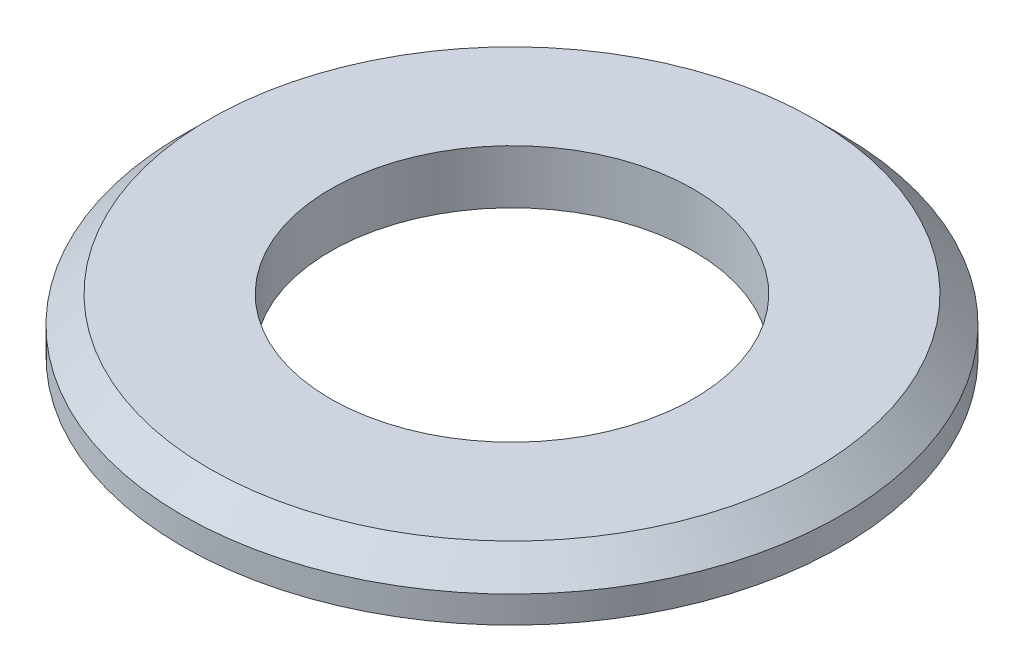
from build123d import *

# Parameters (mm, degrees)
SKETCH1_R      = 49
SKETCH1_R_2    = 27
EXTRUDE1_DEPTH = 8
CHAMFER1_SIZE  = 4


with BuildPart() as part:
    # Sketch1 → Extrude1 (new body)
    with BuildSketch(Plane(origin=(0, 0, 0), x_dir=(1, 0, 0), z_dir=(0, 1, 0))):
        with Locations(Location((0, 0, 0), (0, 0, 270))):
            Circle(SKETCH1_R)
        with Locations(Location((0, 0, 0), (0, 0, 270))):
            Circle(SKETCH1_R_2, mode=Mode.SUBTRACT)
    extrude(amount=EXTRUDE1_DEPTH)

    # Chamfer1
    chamfer1_edges = [part.edges().sort_by_distance(p)[0] for p in [
        (0, 8, -49),
    ]]
    chamfer(chamfer1_edges, length=CHAMFER1_SIZE)


solid = part.part
